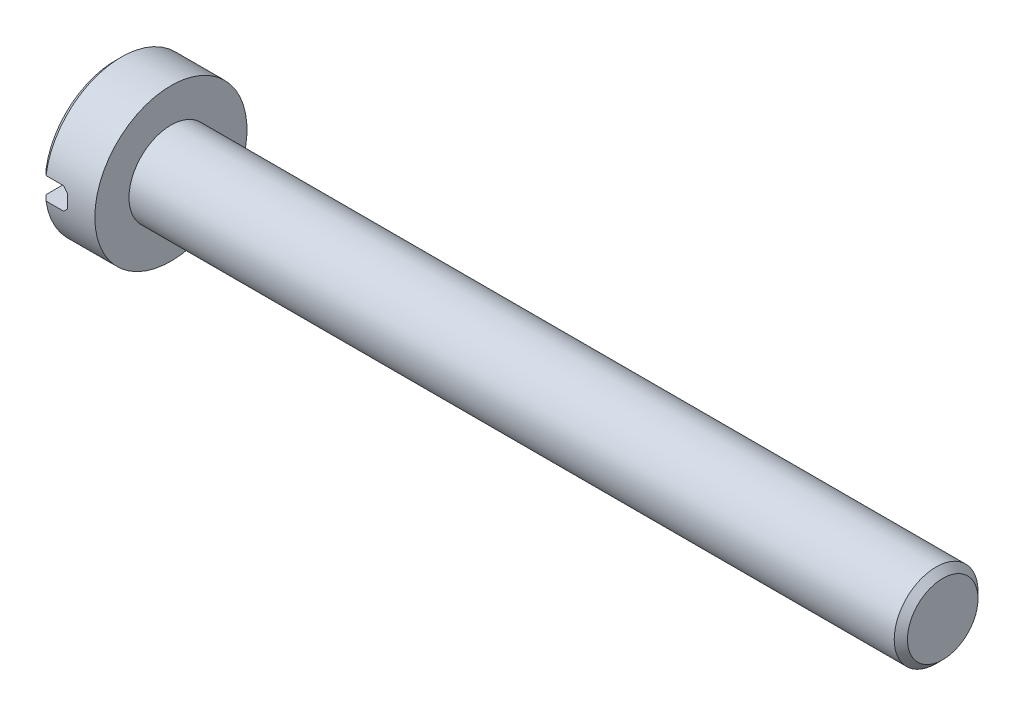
from build123d import *

# Parameters (mm, degrees)
ENL_V_MAT_EXTRU_1_DEPTH = 5
ESQUISSE3_R             = 1.9
EXTRUSION1_DEPTH        = 35
CHANFREIN1_SIZE         = 0.3


with BuildPart() as part:
    # Esquisse1 → R_volution1 (revolve)
    with BuildSketch(Plane.XY, mode=Mode.PRIVATE) as r_volution1_sk:
        Polygon((0, 0), (0, 3.2), (0.25, 3.45), (2.5, 3.45), (2.5, 0), align=None)
    revolve(r_volution1_sk.sketch.rotate(Axis((0, 0, 0), (1, 0, 0)), 90), axis=Axis((0, 0, 0), (1, 0, 0)))

    # Esquisse2 → Enl_v. mat.-Extru.1 (cut, symmetric)
    with BuildSketch(Plane.XY):
        Polygon((0, 0.5), (1.05, 0.5), (1.25, 0.3), (1.25, -0.3), (1.05, -0.5), (0, -0.5), align=None)
    extrude(amount=ENL_V_MAT_EXTRU_1_DEPTH, both=True, mode=Mode.SUBTRACT)

    # Esquisse3 → Extrusion1 (add)
    with BuildSketch(Plane(origin=(2.5, 0, 0), x_dir=(0, 0, -1), z_dir=(1, 0, 0))):
        with Locations(Location((0, 0, 0), (0, 0, 180))):
            Circle(ESQUISSE3_R)
    extrude(amount=EXTRUSION1_DEPTH)

    # Chanfrein1
    chanfrein1_edges = [part.edges().sort_by_distance(p)[0] for p in [
        (37.5, 0, -1.9),
    ]]
    chamfer(chanfrein1_edges, length=CHANFREIN1_SIZE)


solid = part.part
